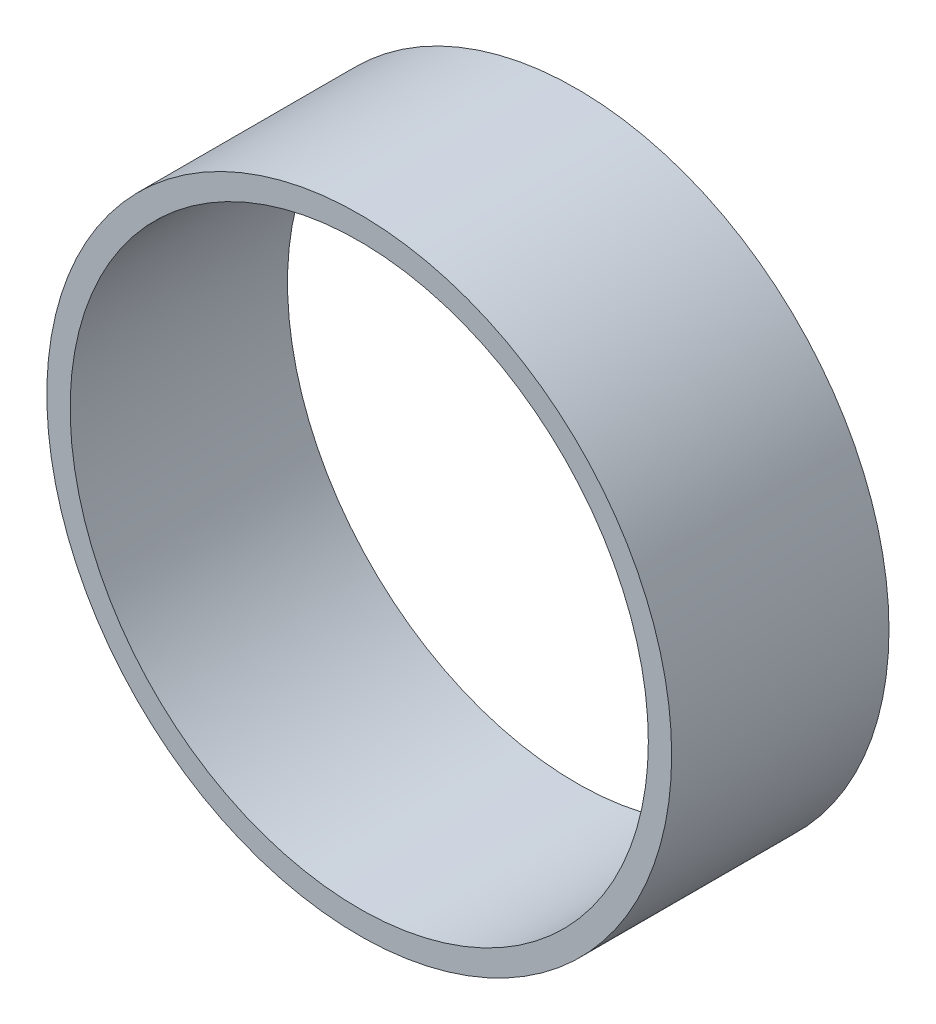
from build123d import *

# Parameters (mm, degrees)
SKETCH1_R      = 109.5375
SKETCH1_R_2    = 101.3587
BASEPIPE_DEPTH = 38.1


with BuildPart() as part:
    # Sketch1 → BasePipe (new, symmetric)
    with BuildSketch(Plane.XY):
        Circle(SKETCH1_R)
        Circle(SKETCH1_R_2, mode=Mode.SUBTRACT)
    extrude(amount=BASEPIPE_DEPTH, both=True)


solid = part.part
